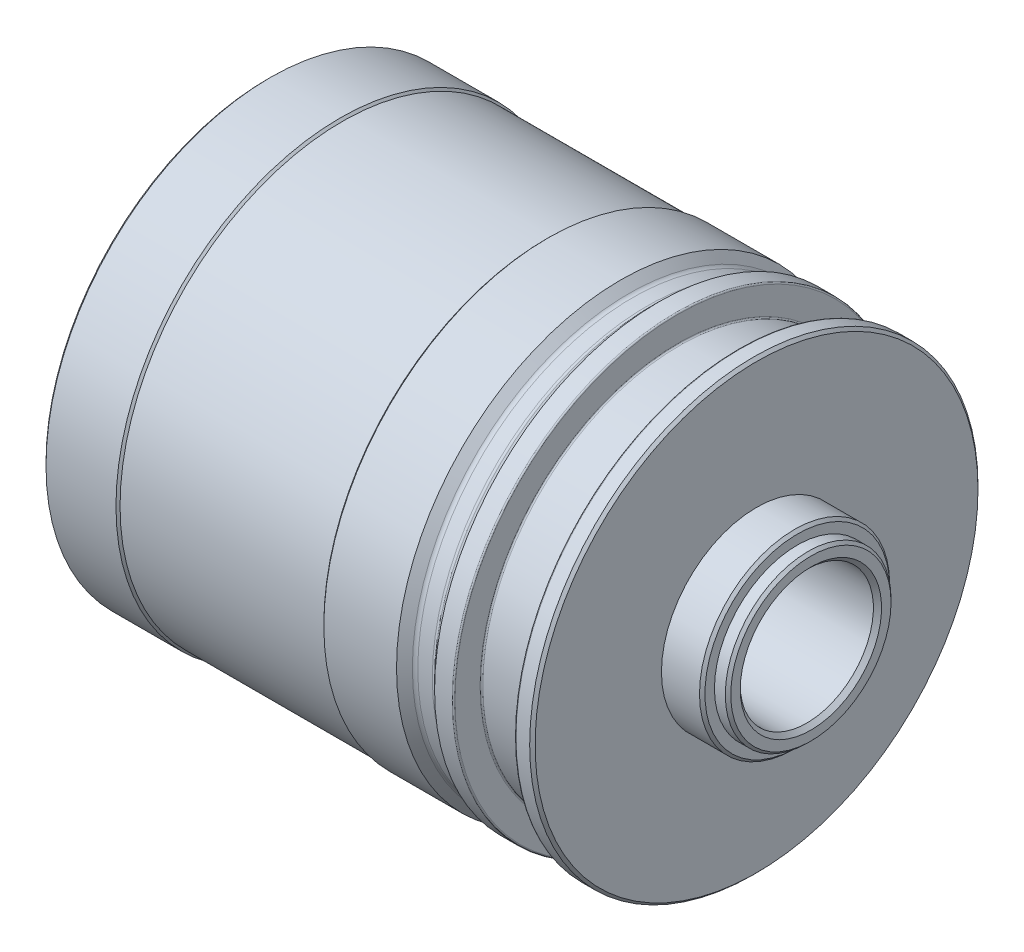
from build123d import *

# Parameters (mm, degrees)
SMUSSO2_SIZE = 0.2
RACCORDO1_R  = 0.4
RACCORDO2_R  = 0.1
SMUSSO3_SIZE = 0.2


with BuildPart() as part:
    # Schizzo1 → Rivoluzione1 (revolve)
    with BuildSketch(Plane(origin=(0, 0, 0), x_dir=(-1, 0, 0), z_dir=(0, 0, -1)), mode=Mode.PRIVATE) as rivoluzione1_sk:
        with BuildLine():
            Line((21.3, 15), (40, 15))
            Line((40, 15), (40, 16.5))
            Line((40, 16.5), (9.8, 16.5))
            Line((9.8, 16.5), (9.8, 14.55))
            ThreePointArc((9.8, 14.55), (9.770710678, 14.479289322), (9.7, 14.45))
            Line((9.7, 14.45), (5.7, 14.45))
            ThreePointArc((5.7, 14.45), (5.417157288, 14.567157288), (5.3, 14.85))
            Line((5.3, 14.85), (5.3, 16.5))
            Line((5.3, 16.5), (4, 16.5))
            Line((4, 16.5), (4, 7))
            Line((4, 7), (1, 7))
            Line((1, 7), (1, 6.1))
            Line((1, 6.1), (0, 6.1))
            Line((0, 6.1), (0, 5.2))
            Line((0, 5.2), (0.3, 4.9))
            Line((0.3, 4.9), (11.3, 4.9))
            Line((11.3, 4.9), (11.3, 4))
            Line((11.3, 4), (21.3, 4))
            Line((21.3, 4), (21.3, 15))
        make_face()
    revolve(rivoluzione1_sk.sketch.rotate(Axis((8, 0, 0), (-1, 0, 0)), 270), axis=Axis((8, 0, 0), (-1, 0, 0)))

    # Schizzo2 → Taglia-Rivoluzione1 (revolve, cut)
    with BuildSketch(Plane(origin=(0, 0, 0), x_dir=(1, 0, 0), z_dir=(0, 1, 0)), mode=Mode.PRIVATE) as taglia_rivoluzione1_sk:
        Polygon((-11.2, 16.5), (-11.9, 15.8), (-13.3, 15.8), (-14, 16.5), align=None)
    revolve(taglia_rivoluzione1_sk.sketch.rotate(Axis((8, 0, 0), (-1, 0, 0)), 180), axis=Axis((8, 0, 0), (-1, 0, 0)), mode=Mode.SUBTRACT)

    # Smusso2
    smusso2_edges = [part.edges().sort_by_distance(p)[0] for p in [
        (-40, 0, -15),
        (-40, 0, -16.5),
        (-1, 0, -7),
        (0, 0, -6.1),
        (-21.3, 0, -4),
    ]]
    chamfer(smusso2_edges, length=SMUSSO2_SIZE)

    # Raccordo1
    raccordo1_edges = [part.edges().sort_by_distance(p)[0] for p in [
        (-11.9, 0, -15.8),
        (-13.3, 0, -15.8),
    ]]
    fillet(raccordo1_edges, radius=RACCORDO1_R)

    # Raccordo2
    raccordo2_edges = [part.edges().sort_by_distance(p)[0] for p in [
        (-9.8, 0, -16.5),
        (-5.3, 0, -16.5),
    ]]
    fillet(raccordo2_edges, radius=RACCORDO2_R)

    # Smusso3
    smusso3_edges = [part.edges().sort_by_distance(p)[0] for p in [
        (-4, 0, -16.5),
    ]]
    chamfer(smusso3_edges, length=SMUSSO3_SIZE)

    # Schizzo3 → Taglia-Rivoluzione2 (revolve, cut)
    with BuildSketch(Plane.XY, mode=Mode.PRIVATE) as taglia_rivoluzione2_sk:
        Polygon((-34.65, 16.5), (-34.5, 16.35), (-19.5, 16.35), (-19.35, 16.5), align=None)
    revolve(taglia_rivoluzione2_sk.sketch.rotate(Axis((8, 0, 0), (-1, 0, 0)), 270), axis=Axis((8, 0, 0), (-1, 0, 0)), mode=Mode.SUBTRACT)


solid = part.part
